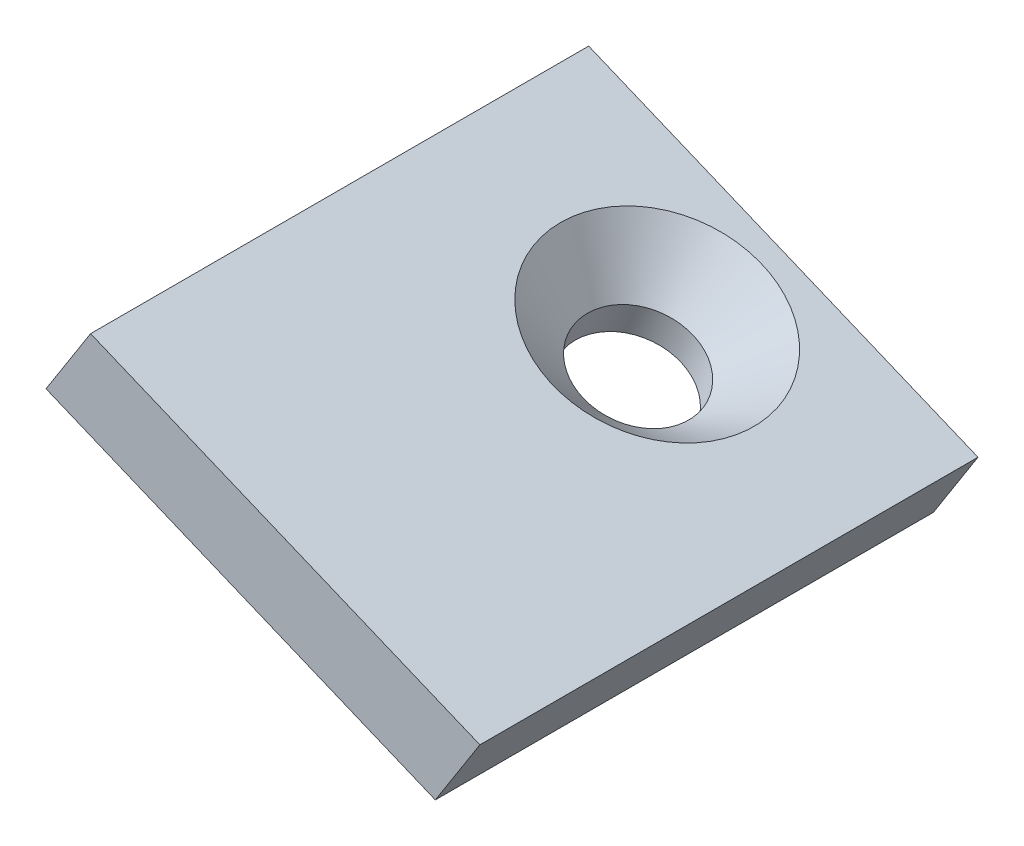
ISO-10303-21;
HEADER;
FILE_DESCRIPTION(('STEP AP214'),'2;1');
FILE_NAME('part.step','',(''),(''),'','','');
FILE_SCHEMA(('AUTOMOTIVE_DESIGN { 1 0 10303 214 1 1 1 1 }'));
ENDSEC;
DATA;
#1=APPLICATION_CONTEXT('core data for automotive mechanical design processes');
#2=APPLICATION_PROTOCOL_DEFINITION('international standard','automotive_design',2000,#1);
#3=PRODUCT_CONTEXT('',#1,'mechanical');
#4=PRODUCT('Part','Part','',(#3));
#5=PRODUCT_RELATED_PRODUCT_CATEGORY('part','',(#4));
#6=PRODUCT_DEFINITION_FORMATION('','',#4);
#7=PRODUCT_DEFINITION_CONTEXT('part definition',#1,'design');
#8=PRODUCT_DEFINITION('design','',#6,#7);
#9=PRODUCT_DEFINITION_SHAPE('','',#8);
#10=(LENGTH_UNIT() NAMED_UNIT(*) SI_UNIT(.MILLI.,.METRE.));
#11=(NAMED_UNIT(*) PLANE_ANGLE_UNIT() SI_UNIT($,.RADIAN.));
#12=(NAMED_UNIT(*) SI_UNIT($,.STERADIAN.) SOLID_ANGLE_UNIT());
#13=UNCERTAINTY_MEASURE_WITH_UNIT(LENGTH_MEASURE(1.E-05),#10,'distance_accuracy_value','');
#14=(GEOMETRIC_REPRESENTATION_CONTEXT(3) GLOBAL_UNCERTAINTY_ASSIGNED_CONTEXT((#13)) GLOBAL_UNIT_ASSIGNED_CONTEXT((#10,
#11,#12)) REPRESENTATION_CONTEXT('',''));
#15=CARTESIAN_POINT('',(0.,0.,0.));
#16=DIRECTION('',(0.,0.,1.));
#17=DIRECTION('',(1.,0.,0.));
#18=AXIS2_PLACEMENT_3D('',#15,#16,#17);
#19=CARTESIAN_POINT('',(133.422906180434,-57.5526408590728,30.));
#20=DIRECTION('',(-0.84353330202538,0.537076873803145,0.));
#21=DIRECTION('',(-0.537076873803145,-0.84353330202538,0.));
#22=AXIS2_PLACEMENT_3D('',#19,#20,#21);
#23=PLANE('',#22);
#24=DIRECTION('',(0.537076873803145,0.84353330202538,0.));
#25=VECTOR('',#24,1.);
#26=CARTESIAN_POINT('',(133.422906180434,-57.5526408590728,0.));
#27=LINE('',#26,#25);
#28=CARTESIAN_POINT('',(130.737521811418,-61.7703073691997,0.));
#29=VERTEX_POINT('',#28);
#30=CARTESIAN_POINT('',(133.422906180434,-57.5526408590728,0.));
#31=VERTEX_POINT('',#30);
#32=EDGE_CURVE('E106',#29,#31,#27,.T.);
#33=ORIENTED_EDGE('',*,*,#32,.T.);
#34=DIRECTION('',(0.,0.,-1.));
#35=VECTOR('',#34,1.);
#36=CARTESIAN_POINT('',(133.422906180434,-57.5526408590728,30.));
#37=LINE('',#36,#35);
#38=CARTESIAN_POINT('',(133.422906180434,-57.5526408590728,30.));
#39=VERTEX_POINT('',#38);
#40=EDGE_CURVE('E11',#39,#31,#37,.T.);
#41=ORIENTED_EDGE('',*,*,#40,.F.);
#42=DIRECTION('',(0.537076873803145,0.84353330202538,0.));
#43=VECTOR('',#42,1.);
#44=CARTESIAN_POINT('',(133.422906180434,-57.5526408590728,30.));
#45=LINE('',#44,#43);
#46=CARTESIAN_POINT('',(130.737521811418,-61.7703073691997,30.));
#47=VERTEX_POINT('',#46);
#48=EDGE_CURVE('E93',#47,#39,#45,.T.);
#49=ORIENTED_EDGE('',*,*,#48,.F.);
#50=DIRECTION('',(0.,0.,-1.));
#51=VECTOR('',#50,1.);
#52=CARTESIAN_POINT('',(130.737521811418,-61.7703073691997,30.));
#53=LINE('',#52,#51);
#54=EDGE_CURVE('E102',#47,#29,#53,.T.);
#55=ORIENTED_EDGE('',*,*,#54,.T.);
#56=EDGE_LOOP('',(#33,#41,#49,#55));
#57=FACE_BOUND('',#56,.T.);
#58=ADVANCED_FACE('F41',(#57),#23,.F.);
#59=CARTESIAN_POINT('',(109.976178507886,-47.8298159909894,30.));
#60=DIRECTION('',(-0.383049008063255,-0.923728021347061,0.));
#61=DIRECTION('',(0.923728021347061,-0.383049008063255,0.));
#62=AXIS2_PLACEMENT_3D('',#59,#60,#61);
#63=PLANE('',#62);
#64=CARTESIAN_POINT('',(121.69954234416,-52.6912284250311,7.59783985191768));
#65=DIRECTION('',(0.383049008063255,0.923728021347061,0.));
#66=DIRECTION('',(-0.923728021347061,0.383049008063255,0.));
#67=AXIS2_PLACEMENT_3D('',#64,#65,#66);
#68=CIRCLE('',#67,6.3);
#69=CARTESIAN_POINT('',(115.880055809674,-50.2780196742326,7.59783985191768));
#70=VERTEX_POINT('',#69);
#71=EDGE_CURVE('E122',#70,#70,#68,.T.);
#72=ORIENTED_EDGE('',*,*,#71,.F.);
#73=EDGE_LOOP('',(#72));
#74=FACE_BOUND('',#73,.T.);
#75=DIRECTION('',(-0.923728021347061,0.383049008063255,0.));
#76=VECTOR('',#75,1.);
#77=CARTESIAN_POINT('',(109.976178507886,-47.8298159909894,0.));
#78=LINE('',#77,#76);
#79=CARTESIAN_POINT('',(109.976178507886,-47.8298159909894,0.));
#80=VERTEX_POINT('',#79);
#81=EDGE_CURVE('E97',#31,#80,#78,.T.);
#82=ORIENTED_EDGE('',*,*,#81,.T.);
#83=DIRECTION('',(0.,0.,-1.));
#84=VECTOR('',#83,1.);
#85=CARTESIAN_POINT('',(109.976178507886,-47.8298159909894,30.));
#86=LINE('',#85,#84);
#87=CARTESIAN_POINT('',(109.976178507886,-47.8298159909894,30.));
#88=VERTEX_POINT('',#87);
#89=EDGE_CURVE('E50',#88,#80,#86,.T.);
#90=ORIENTED_EDGE('',*,*,#89,.F.);
#91=DIRECTION('',(-0.923728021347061,0.383049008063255,0.));
#92=VECTOR('',#91,1.);
#93=CARTESIAN_POINT('',(109.976178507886,-47.8298159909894,30.));
#94=LINE('',#93,#92);
#95=EDGE_CURVE('E88',#39,#88,#94,.T.);
#96=ORIENTED_EDGE('',*,*,#95,.F.);
#97=ORIENTED_EDGE('',*,*,#40,.T.);
#98=EDGE_LOOP('',(#82,#90,#96,#97));
#99=FACE_BOUND('',#98,.T.);
#100=ADVANCED_FACE('F96',(#74,#99),#63,.F.);
#101=CARTESIAN_POINT('',(107.290794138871,-52.0474825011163,30.));
#102=DIRECTION('',(0.84353330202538,-0.537076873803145,0.));
#103=DIRECTION('',(0.537076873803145,0.84353330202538,0.));
#104=AXIS2_PLACEMENT_3D('',#101,#102,#103);
#105=PLANE('',#104);
#106=DIRECTION('',(-0.537076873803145,-0.84353330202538,0.));
#107=VECTOR('',#106,1.);
#108=CARTESIAN_POINT('',(107.290794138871,-52.0474825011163,0.));
#109=LINE('',#108,#107);
#110=CARTESIAN_POINT('',(107.290794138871,-52.0474825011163,0.));
#111=VERTEX_POINT('',#110);
#112=EDGE_CURVE('E75',#80,#111,#109,.T.);
#113=ORIENTED_EDGE('',*,*,#112,.T.);
#114=DIRECTION('',(0.,0.,-1.));
#115=VECTOR('',#114,1.);
#116=CARTESIAN_POINT('',(107.290794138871,-52.0474825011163,30.));
#117=LINE('',#116,#115);
#118=CARTESIAN_POINT('',(107.290794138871,-52.0474825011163,30.));
#119=VERTEX_POINT('',#118);
#120=EDGE_CURVE('E98',#119,#111,#117,.T.);
#121=ORIENTED_EDGE('',*,*,#120,.F.);
#122=DIRECTION('',(-0.537076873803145,-0.84353330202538,0.));
#123=VECTOR('',#122,1.);
#124=CARTESIAN_POINT('',(107.290794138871,-52.0474825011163,30.));
#125=LINE('',#124,#123);
#126=EDGE_CURVE('E91',#88,#119,#125,.T.);
#127=ORIENTED_EDGE('',*,*,#126,.F.);
#128=ORIENTED_EDGE('',*,*,#89,.T.);
#129=EDGE_LOOP('',(#113,#121,#127,#128));
#130=FACE_BOUND('',#129,.T.);
#131=ADVANCED_FACE('F100',(#130),#105,.F.);
#132=CARTESIAN_POINT('',(130.737521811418,-61.7703073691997,30.));
#133=DIRECTION('',(0.383049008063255,0.923728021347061,0.));
#134=DIRECTION('',(-0.923728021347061,0.383049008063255,0.));
#135=AXIS2_PLACEMENT_3D('',#132,#133,#134);
#136=PLANE('',#135);
#137=CARTESIAN_POINT('',(119.813175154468,-57.2402291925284,7.59783985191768));
#138=DIRECTION('',(0.383049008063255,0.923728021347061,0.));
#139=DIRECTION('',(-0.923728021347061,0.383049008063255,0.));
#140=AXIS2_PLACEMENT_3D('',#137,#138,#139);
#141=CIRCLE('',#140,3.3);
#142=CARTESIAN_POINT('',(116.764872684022,-55.9761674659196,7.59783985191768));
#143=VERTEX_POINT('',#142);
#144=EDGE_CURVE('E44',#143,#143,#141,.T.);
#145=ORIENTED_EDGE('',*,*,#144,.T.);
#146=EDGE_LOOP('',(#145));
#147=FACE_BOUND('',#146,.T.);
#148=DIRECTION('',(0.923728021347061,-0.383049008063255,0.));
#149=VECTOR('',#148,1.);
#150=CARTESIAN_POINT('',(130.737521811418,-61.7703073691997,0.));
#151=LINE('',#150,#149);
#152=EDGE_CURVE('E81',#111,#29,#151,.T.);
#153=ORIENTED_EDGE('',*,*,#152,.T.);
#154=ORIENTED_EDGE('',*,*,#54,.F.);
#155=DIRECTION('',(0.923728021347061,-0.383049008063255,0.));
#156=VECTOR('',#155,1.);
#157=CARTESIAN_POINT('',(130.737521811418,-61.7703073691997,30.));
#158=LINE('',#157,#156);
#159=EDGE_CURVE('E58',#119,#47,#158,.T.);
#160=ORIENTED_EDGE('',*,*,#159,.F.);
#161=ORIENTED_EDGE('',*,*,#120,.T.);
#162=EDGE_LOOP('',(#153,#154,#160,#161));
#163=FACE_BOUND('',#162,.T.);
#164=ADVANCED_FACE('F113',(#147,#163),#136,.F.);
#165=CARTESIAN_POINT('',(0.,0.,30.));
#166=DIRECTION('',(0.,0.,-1.));
#167=DIRECTION('',(-1.,0.,0.));
#168=AXIS2_PLACEMENT_3D('',#165,#166,#167);
#169=PLANE('',#168);
#170=ORIENTED_EDGE('',*,*,#48,.T.);
#171=ORIENTED_EDGE('',*,*,#95,.T.);
#172=ORIENTED_EDGE('',*,*,#126,.T.);
#173=ORIENTED_EDGE('',*,*,#159,.T.);
#174=EDGE_LOOP('',(#170,#171,#172,#173));
#175=FACE_BOUND('',#174,.T.);
#176=ADVANCED_FACE('F89',(#175),#169,.F.);
#177=CARTESIAN_POINT('',(0.,0.,0.));
#178=DIRECTION('',(0.,0.,-1.));
#179=DIRECTION('',(-1.,0.,0.));
#180=AXIS2_PLACEMENT_3D('',#177,#178,#179);
#181=PLANE('',#180);
#182=ORIENTED_EDGE('',*,*,#32,.F.);
#183=ORIENTED_EDGE('',*,*,#152,.F.);
#184=ORIENTED_EDGE('',*,*,#112,.F.);
#185=ORIENTED_EDGE('',*,*,#81,.F.);
#186=EDGE_LOOP('',(#182,#183,#184,#185));
#187=FACE_BOUND('',#186,.T.);
#188=ADVANCED_FACE('F116',(#187),#181,.T.);
#189=CARTESIAN_POINT('',(121.69954234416,-52.6912284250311,7.59783985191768));
#190=DIRECTION('',(0.383049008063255,0.923728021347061,0.));
#191=DIRECTION('',(-0.923728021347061,0.383049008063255,0.));
#192=AXIS2_PLACEMENT_3D('',#189,#190,#191);
#193=CYLINDRICAL_SURFACE('',#192,3.3);
#194=CARTESIAN_POINT('',(120.55039531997,-55.4624124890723,7.59783985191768));
#195=DIRECTION('',(0.383049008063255,0.923728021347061,0.));
#196=DIRECTION('',(-0.923728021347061,0.383049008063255,0.));
#197=AXIS2_PLACEMENT_3D('',#194,#195,#196);
#198=CIRCLE('',#197,3.3);
#199=CARTESIAN_POINT('',(117.502092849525,-54.1983507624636,7.59783985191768));
#200=VERTEX_POINT('',#199);
#201=EDGE_CURVE('E119',#200,#200,#198,.T.);
#202=ORIENTED_EDGE('',*,*,#201,.T.);
#203=EDGE_LOOP('',(#202));
#204=FACE_BOUND('',#203,.T.);
#205=ORIENTED_EDGE('',*,*,#144,.F.);
#206=EDGE_LOOP('',(#205));
#207=FACE_BOUND('',#206,.T.);
#208=ADVANCED_FACE('F140',(#204,#207),#193,.F.);
#209=CARTESIAN_POINT('',(121.69954234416,-52.6912284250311,7.59783985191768));
#210=DIRECTION('',(0.383049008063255,0.923728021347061,0.));
#211=DIRECTION('',(-0.923728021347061,0.383049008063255,0.));
#212=AXIS2_PLACEMENT_3D('',#209,#210,#211);
#213=CONICAL_SURFACE('',#212,6.3,0.785398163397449);
#214=ORIENTED_EDGE('',*,*,#201,.F.);
#215=EDGE_LOOP('',(#214));
#216=FACE_BOUND('',#215,.T.);
#217=ORIENTED_EDGE('',*,*,#71,.T.);
#218=EDGE_LOOP('',(#217));
#219=FACE_BOUND('',#218,.T.);
#220=ADVANCED_FACE('F126',(#216,#219),#213,.F.);
#221=CLOSED_SHELL('',(#58,#100,#131,#164,#176,#188,#208,#220));
#222=MANIFOLD_SOLID_BREP('B2',#221);
#223=ADVANCED_BREP_SHAPE_REPRESENTATION('',(#18,#222),#14);
#224=SHAPE_DEFINITION_REPRESENTATION(#9,#223);
ENDSEC;
END-ISO-10303-21;
